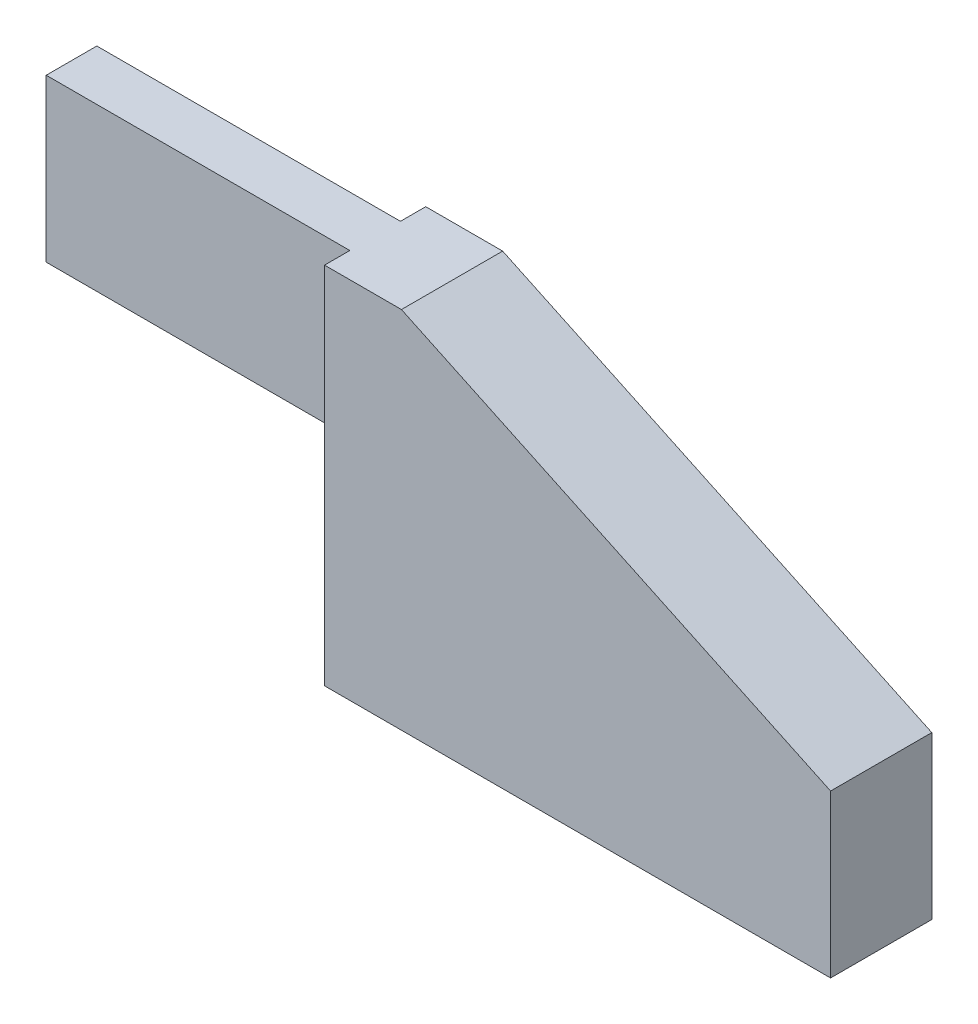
from build123d import *

# Parameters (mm, degrees)
BASE_EXTRUDE_DEPTH = 12.7
SKETCH3_W          = 38.1
SKETCH3_H          = 3.175
CUT_EXTRUDE1_DEPTH = 106.494123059


with BuildPart() as part:
    # Sketch1 → Base-Extrude (new body)
    with BuildSketch(Plane.XY):
        Polygon((0, 0), (-63.5, 0), (-63.5, 25.4), (-101.6, 25.4), (-101.6, 45.72), (-53.848, 45.72), (0, 20.32), align=None)
    extrude(amount=BASE_EXTRUDE_DEPTH)

    # Sketch3 → Cut-Extrude1 (cut, through all)
    with BuildSketch(Plane.XZ.offset(-25.4)):
        with Locations((-82.55, 11.1125)):
            Rectangle(SKETCH3_W, SKETCH3_H)
        with Locations((-82.55, 1.5875)):
            Rectangle(SKETCH3_W, SKETCH3_H)
    extrude(amount=-CUT_EXTRUDE1_DEPTH, mode=Mode.SUBTRACT)


solid = part.part
